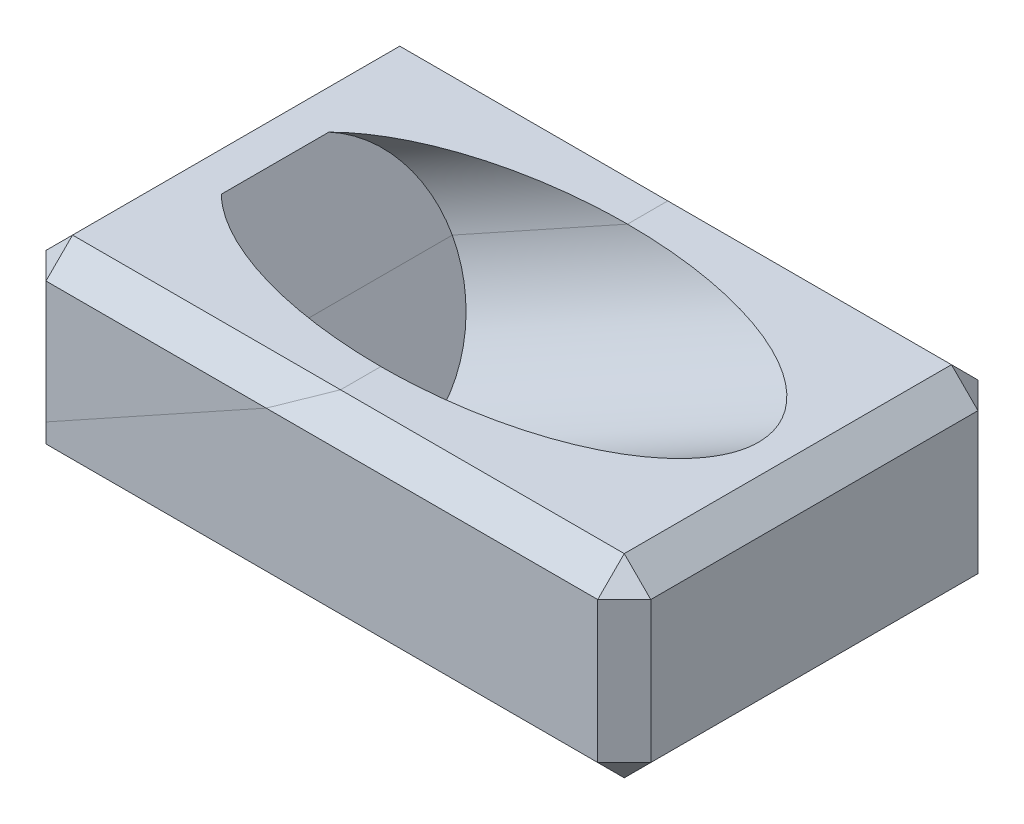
ISO-10303-21;
HEADER;
FILE_DESCRIPTION(('STEP AP214'),'2;1');
FILE_NAME('part.step','',(''),(''),'','','');
FILE_SCHEMA(('AUTOMOTIVE_DESIGN { 1 0 10303 214 1 1 1 1 }'));
ENDSEC;
DATA;
#1=APPLICATION_CONTEXT('core data for automotive mechanical design processes');
#2=APPLICATION_PROTOCOL_DEFINITION('international standard','automotive_design',2000,#1);
#3=PRODUCT_CONTEXT('',#1,'mechanical');
#4=PRODUCT('Part','Part','',(#3));
#5=PRODUCT_RELATED_PRODUCT_CATEGORY('part','',(#4));
#6=PRODUCT_DEFINITION_FORMATION('','',#4);
#7=PRODUCT_DEFINITION_CONTEXT('part definition',#1,'design');
#8=PRODUCT_DEFINITION('design','',#6,#7);
#9=PRODUCT_DEFINITION_SHAPE('','',#8);
#10=(LENGTH_UNIT() NAMED_UNIT(*) SI_UNIT(.MILLI.,.METRE.));
#11=(NAMED_UNIT(*) PLANE_ANGLE_UNIT() SI_UNIT($,.RADIAN.));
#12=(NAMED_UNIT(*) SI_UNIT($,.STERADIAN.) SOLID_ANGLE_UNIT());
#13=UNCERTAINTY_MEASURE_WITH_UNIT(LENGTH_MEASURE(1.E-05),#10,'distance_accuracy_value','');
#14=(GEOMETRIC_REPRESENTATION_CONTEXT(3) GLOBAL_UNCERTAINTY_ASSIGNED_CONTEXT((#13)) GLOBAL_UNIT_ASSIGNED_CONTEXT((#10,
#11,#12)) REPRESENTATION_CONTEXT('',''));
#15=CARTESIAN_POINT('',(0.,0.,0.));
#16=DIRECTION('',(0.,0.,1.));
#17=DIRECTION('',(1.,0.,0.));
#18=AXIS2_PLACEMENT_3D('',#15,#16,#17);
#19=CARTESIAN_POINT('',(-31.7413057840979,57.2628314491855,0.));
#20=DIRECTION('',(-0.484809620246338,0.874619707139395,0.));
#21=DIRECTION('',(-0.874619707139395,-0.484809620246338,0.));
#22=AXIS2_PLACEMENT_3D('',#19,#20,#21);
#23=PLANE('',#22);
#24=DIRECTION('',(0.658342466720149,0.364925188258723,-0.658342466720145));
#25=VECTOR('',#24,1.);
#26=CARTESIAN_POINT('',(-99.2119354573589,19.8632507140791,-76.4680645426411));
#27=LINE('',#26,#25);
#28=CARTESIAN_POINT('',(-114.,11.6660926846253,-61.68));
#29=VERTEX_POINT('',#28);
#30=CARTESIAN_POINT('',(-104.,17.2091831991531,-71.68));
#31=VERTEX_POINT('',#30);
#32=EDGE_CURVE('E56',#29,#31,#27,.T.);
#33=ORIENTED_EDGE('',*,*,#32,.T.);
#34=DIRECTION('',(0.874619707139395,0.484809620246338,0.));
#35=VECTOR('',#34,1.);
#36=CARTESIAN_POINT('',(-87.8996630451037,26.1337457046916,-71.68));
#37=LINE('',#36,#35);
#38=CARTESIAN_POINT('',(-20.9942892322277,63.22,-71.68));
#39=VERTEX_POINT('',#38);
#40=EDGE_CURVE('E222',#31,#39,#37,.T.);
#41=ORIENTED_EDGE('',*,*,#40,.T.);
#42=DIRECTION('',(0.787007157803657,0.436245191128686,0.436245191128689));
#43=VECTOR('',#42,1.);
#44=CARTESIAN_POINT('',(-78.6001911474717,31.2885271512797,-103.61147284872));
#45=LINE('',#44,#43);
#46=CARTESIAN_POINT('',(-2.95381167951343,73.22,-61.6799999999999));
#47=VERTEX_POINT('',#46);
#48=EDGE_CURVE('E218',#39,#47,#45,.T.);
#49=ORIENTED_EDGE('',*,*,#48,.T.);
#50=DIRECTION('',(0.,0.,-1.));
#51=VECTOR('',#50,1.);
#52=CARTESIAN_POINT('',(-2.95381167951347,73.22,0.));
#53=LINE('',#52,#51);
#54=CARTESIAN_POINT('',(-2.95381167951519,73.22,-46.5));
#55=VERTEX_POINT('',#54);
#56=EDGE_CURVE('E210',#55,#47,#53,.T.);
#57=ORIENTED_EDGE('',*,*,#56,.F.);
#58=DIRECTION('',(-0.874619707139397,-0.484809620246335,0.));
#59=VECTOR('',#58,1.);
#60=CARTESIAN_POINT('',(193.385912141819,182.052886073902,-46.5));
#61=LINE('',#60,#59);
#62=CARTESIAN_POINT('',(-69.0000000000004,36.6100000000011,-46.5));
#63=VERTEX_POINT('',#62);
#64=EDGE_CURVE('E140',#63,#55,#61,.F.);
#65=ORIENTED_EDGE('',*,*,#64,.F.);
#66=DIRECTION('',(0.,0.,-1.));
#67=VECTOR('',#66,1.);
#68=CARTESIAN_POINT('',(-68.9999999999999,36.6100000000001,0.));
#69=LINE('',#68,#67);
#70=CARTESIAN_POINT('',(-69.0000000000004,36.6100000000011,46.5));
#71=VERTEX_POINT('',#70);
#72=EDGE_CURVE('E153',#71,#63,#69,.T.);
#73=ORIENTED_EDGE('',*,*,#72,.F.);
#74=DIRECTION('',(-0.874619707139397,-0.484809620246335,0.));
#75=VECTOR('',#74,1.);
#76=CARTESIAN_POINT('',(193.385912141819,182.052886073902,46.5));
#77=LINE('',#76,#75);
#78=CARTESIAN_POINT('',(-2.95381167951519,73.22,46.5));
#79=VERTEX_POINT('',#78);
#80=EDGE_CURVE('E190',#79,#71,#77,.T.);
#81=ORIENTED_EDGE('',*,*,#80,.F.);
#82=CARTESIAN_POINT('',(-2.95381167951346,73.22,61.68));
#83=VERTEX_POINT('',#82);
#84=EDGE_CURVE('E211',#83,#79,#53,.T.);
#85=ORIENTED_EDGE('',*,*,#84,.F.);
#86=DIRECTION('',(0.787007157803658,0.436245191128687,-0.436245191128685));
#87=VECTOR('',#86,1.);
#88=CARTESIAN_POINT('',(-1.12427901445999,74.2341265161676,60.6658734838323));
#89=LINE('',#88,#87);
#90=CARTESIAN_POINT('',(-20.9942892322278,63.2199999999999,71.68));
#91=VERTEX_POINT('',#90);
#92=EDGE_CURVE('E12',#83,#91,#89,.F.);
#93=ORIENTED_EDGE('',*,*,#92,.T.);
#94=DIRECTION('',(0.874619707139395,0.484809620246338,0.));
#95=VECTOR('',#94,1.);
#96=CARTESIAN_POINT('',(-87.8996630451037,26.1337457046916,71.68));
#97=LINE('',#96,#95);
#98=CARTESIAN_POINT('',(-104.,17.2091831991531,71.68));
#99=VERTEX_POINT('',#98);
#100=EDGE_CURVE('E69',#99,#91,#97,.T.);
#101=ORIENTED_EDGE('',*,*,#100,.F.);
#102=DIRECTION('',(0.658342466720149,0.364925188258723,0.658342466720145));
#103=VECTOR('',#102,1.);
#104=CARTESIAN_POINT('',(-90.5436393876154,24.6681656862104,85.1363606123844));
#105=LINE('',#104,#103);
#106=CARTESIAN_POINT('',(-114.,11.6660926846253,61.68));
#107=VERTEX_POINT('',#106);
#108=EDGE_CURVE('E61',#99,#107,#105,.F.);
#109=ORIENTED_EDGE('',*,*,#108,.T.);
#110=DIRECTION('',(0.,0.,1.));
#111=VECTOR('',#110,1.);
#112=CARTESIAN_POINT('',(-114.,11.6660926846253,-71.68));
#113=LINE('',#112,#111);
#114=EDGE_CURVE('E215',#29,#107,#113,.T.);
#115=ORIENTED_EDGE('',*,*,#114,.F.);
#116=EDGE_LOOP('',(#33,#41,#49,#57,#65,#73,#81,#85,#93,#101,#109,#115));
#117=FACE_BOUND('',#116,.T.);
#118=ADVANCED_FACE('F53',(#117),#23,.F.);
#119=CARTESIAN_POINT('',(-104.,73.22,0.));
#120=DIRECTION('',(0.707106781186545,-0.707106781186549,0.));
#121=DIRECTION('',(0.,0.,1.));
#122=AXIS2_PLACEMENT_3D('',#119,#120,#121);
#123=PLANE('',#122);
#124=DIRECTION('',(-0.707106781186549,-0.707106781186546,0.));
#125=VECTOR('',#124,1.);
#126=CARTESIAN_POINT('',(-104.,73.22,-61.6799999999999));
#127=LINE('',#126,#125);
#128=CARTESIAN_POINT('',(-104.,73.22,-61.6799999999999));
#129=VERTEX_POINT('',#128);
#130=CARTESIAN_POINT('',(-114.,63.22,-61.68));
#131=VERTEX_POINT('',#130);
#132=EDGE_CURVE('E197',#129,#131,#127,.T.);
#133=ORIENTED_EDGE('',*,*,#132,.T.);
#134=DIRECTION('',(0.,0.,-1.));
#135=VECTOR('',#134,1.);
#136=CARTESIAN_POINT('',(-114.,63.22,-71.68));
#137=LINE('',#136,#135);
#138=CARTESIAN_POINT('',(-114.,63.22,61.68));
#139=VERTEX_POINT('',#138);
#140=EDGE_CURVE('E186',#139,#131,#137,.T.);
#141=ORIENTED_EDGE('',*,*,#140,.F.);
#142=DIRECTION('',(0.707106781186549,0.707106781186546,0.));
#143=VECTOR('',#142,1.);
#144=CARTESIAN_POINT('',(-109.,68.22,61.68));
#145=LINE('',#144,#143);
#146=CARTESIAN_POINT('',(-104.,73.22,61.68));
#147=VERTEX_POINT('',#146);
#148=EDGE_CURVE('E163',#147,#139,#145,.F.);
#149=ORIENTED_EDGE('',*,*,#148,.F.);
#150=DIRECTION('',(0.,0.,1.));
#151=VECTOR('',#150,1.);
#152=CARTESIAN_POINT('',(-104.,73.22,0.));
#153=LINE('',#152,#151);
#154=EDGE_CURVE('E166',#129,#147,#153,.T.);
#155=ORIENTED_EDGE('',*,*,#154,.F.);
#156=EDGE_LOOP('',(#133,#141,#149,#155));
#157=FACE_BOUND('',#156,.T.);
#158=ADVANCED_FACE('F266',(#157),#123,.F.);
#159=CARTESIAN_POINT('',(-114.,73.22,-71.68));
#160=DIRECTION('',(1.,0.,0.));
#161=DIRECTION('',(0.,0.,-1.));
#162=AXIS2_PLACEMENT_3D('',#159,#160,#161);
#163=PLANE('',#162);
#164=DIRECTION('',(0.,-1.,0.));
#165=VECTOR('',#164,1.);
#166=CARTESIAN_POINT('',(-114.,0.,-61.68));
#167=LINE('',#166,#165);
#168=EDGE_CURVE('E188',#131,#29,#167,.T.);
#169=ORIENTED_EDGE('',*,*,#168,.T.);
#170=ORIENTED_EDGE('',*,*,#114,.T.);
#171=DIRECTION('',(0.,1.,0.));
#172=VECTOR('',#171,1.);
#173=CARTESIAN_POINT('',(-114.,73.22,61.68));
#174=LINE('',#173,#172);
#175=EDGE_CURVE('E184',#107,#139,#174,.T.);
#176=ORIENTED_EDGE('',*,*,#175,.T.);
#177=ORIENTED_EDGE('',*,*,#140,.T.);
#178=EDGE_LOOP('',(#169,#170,#176,#177));
#179=FACE_BOUND('',#178,.T.);
#180=ADVANCED_FACE('F259',(#179),#163,.F.);
#181=CARTESIAN_POINT('',(-114.,73.22,71.68));
#182=DIRECTION('',(0.,0.,-1.));
#183=DIRECTION('',(-1.,0.,0.));
#184=AXIS2_PLACEMENT_3D('',#181,#182,#183);
#185=PLANE('',#184);
#186=DIRECTION('',(0.,-1.,0.));
#187=VECTOR('',#186,1.);
#188=CARTESIAN_POINT('',(-104.,73.22,71.68));
#189=LINE('',#188,#187);
#190=CARTESIAN_POINT('',(-104.,63.2199999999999,71.68));
#191=VERTEX_POINT('',#190);
#192=EDGE_CURVE('E174',#191,#99,#189,.T.);
#193=ORIENTED_EDGE('',*,*,#192,.T.);
#194=ORIENTED_EDGE('',*,*,#100,.T.);
#195=DIRECTION('',(-1.,0.,0.));
#196=VECTOR('',#195,1.);
#197=CARTESIAN_POINT('',(-114.,63.2199999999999,71.68));
#198=LINE('',#197,#196);
#199=EDGE_CURVE('E176',#91,#191,#198,.T.);
#200=ORIENTED_EDGE('',*,*,#199,.T.);
#201=EDGE_LOOP('',(#193,#194,#200));
#202=FACE_BOUND('',#201,.T.);
#203=ADVANCED_FACE('F257',(#202),#185,.F.);
#204=CARTESIAN_POINT('',(-104.,63.2199999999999,71.68));
#205=DIRECTION('',(-0.577350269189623,0.577350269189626,0.577350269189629));
#206=DIRECTION('',(0.,-0.707106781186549,0.707106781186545));
#207=AXIS2_PLACEMENT_3D('',#204,#205,#206);
#208=PLANE('',#207);
#209=ORIENTED_EDGE('',*,*,#148,.T.);
#210=DIRECTION('',(-0.707106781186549,0.,-0.707106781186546));
#211=VECTOR('',#210,1.);
#212=CARTESIAN_POINT('',(-104.,63.2199999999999,71.68));
#213=LINE('',#212,#211);
#214=EDGE_CURVE('E194',#139,#191,#213,.F.);
#215=ORIENTED_EDGE('',*,*,#214,.T.);
#216=DIRECTION('',(0.,-0.707106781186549,0.707106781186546));
#217=VECTOR('',#216,1.);
#218=CARTESIAN_POINT('',(-104.,63.2199999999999,71.68));
#219=LINE('',#218,#217);
#220=EDGE_CURVE('E160',#147,#191,#219,.T.);
#221=ORIENTED_EDGE('',*,*,#220,.F.);
#222=EDGE_LOOP('',(#209,#215,#221));
#223=FACE_BOUND('',#222,.T.);
#224=ADVANCED_FACE('F253',(#223),#208,.T.);
#225=CARTESIAN_POINT('',(-68.9999999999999,36.6100000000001,0.));
#226=DIRECTION('',(-0.874619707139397,-0.484809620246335,0.));
#227=DIRECTION('',(0.484809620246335,-0.874619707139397,0.));
#228=AXIS2_PLACEMENT_3D('',#225,#226,#227);
#229=PLANE('',#228);
#230=CARTESIAN_POINT('',(-68.9999999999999,36.6100000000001,0.));
#231=DIRECTION('',(-0.874619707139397,-0.484809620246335,0.));
#232=DIRECTION('',(0.484809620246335,-0.874619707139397,0.));
#233=AXIS2_PLACEMENT_3D('',#230,#231,#232);
#234=CIRCLE('',#233,46.5);
#235=CARTESIAN_POINT('',(-89.2932543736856,73.22,20.251956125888));
#236=VERTEX_POINT('',#235);
#237=EDGE_CURVE('E154',#71,#236,#234,.T.);
#238=ORIENTED_EDGE('',*,*,#237,.F.);
#239=ORIENTED_EDGE('',*,*,#72,.T.);
#240=CARTESIAN_POINT('',(-89.2932543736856,73.22,-20.251956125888));
#241=VERTEX_POINT('',#240);
#242=EDGE_CURVE('E138',#241,#63,#234,.T.);
#243=ORIENTED_EDGE('',*,*,#242,.F.);
#244=DIRECTION('',(0.,0.,-1.));
#245=VECTOR('',#244,1.);
#246=CARTESIAN_POINT('',(-89.2932543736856,73.22,0.));
#247=LINE('',#246,#245);
#248=EDGE_CURVE('E145',#236,#241,#247,.T.);
#249=ORIENTED_EDGE('',*,*,#248,.F.);
#250=EDGE_LOOP('',(#238,#239,#243,#249));
#251=FACE_BOUND('',#250,.T.);
#252=ADVANCED_FACE('F151',(#251),#229,.F.);
#253=CARTESIAN_POINT('',(0.,73.22,0.));
#254=DIRECTION('',(0.,-1.,0.));
#255=DIRECTION('',(0.,0.,-1.));
#256=AXIS2_PLACEMENT_3D('',#253,#254,#255);
#257=PLANE('',#256);
#258=DIRECTION('',(1.,0.,0.));
#259=VECTOR('',#258,1.);
#260=CARTESIAN_POINT('',(0.,73.22,61.68));
#261=LINE('',#260,#259);
#262=EDGE_CURVE('E172',#147,#83,#261,.T.);
#263=ORIENTED_EDGE('',*,*,#262,.T.);
#264=ORIENTED_EDGE('',*,*,#84,.T.);
#265=CARTESIAN_POINT('',(-2.95381167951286,73.22,0.));
#266=DIRECTION('',(0.,-1.,0.));
#267=DIRECTION('',(-1.,0.,0.));
#268=AXIS2_PLACEMENT_3D('',#265,#266,#267);
#269=ELLIPSE('',#268,95.9139382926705,46.5);
#270=EDGE_CURVE('E146',#79,#236,#269,.T.);
#271=ORIENTED_EDGE('',*,*,#270,.T.);
#272=ORIENTED_EDGE('',*,*,#248,.T.);
#273=EDGE_CURVE('E135',#241,#55,#269,.T.);
#274=ORIENTED_EDGE('',*,*,#273,.T.);
#275=ORIENTED_EDGE('',*,*,#56,.T.);
#276=DIRECTION('',(-1.,0.,0.));
#277=VECTOR('',#276,1.);
#278=CARTESIAN_POINT('',(-114.,73.22,-61.6799999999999));
#279=LINE('',#278,#277);
#280=EDGE_CURVE('E168',#47,#129,#279,.T.);
#281=ORIENTED_EDGE('',*,*,#280,.T.);
#282=ORIENTED_EDGE('',*,*,#154,.T.);
#283=EDGE_LOOP('',(#263,#264,#271,#272,#274,#275,#281,#282));
#284=FACE_BOUND('',#283,.T.);
#285=ADVANCED_FACE('F157',(#284),#257,.F.);
#286=CARTESIAN_POINT('',(193.385912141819,182.052886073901,0.));
#287=DIRECTION('',(-0.874619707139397,-0.484809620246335,0.));
#288=DIRECTION('',(0.484809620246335,-0.874619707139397,0.));
#289=AXIS2_PLACEMENT_3D('',#286,#287,#288);
#290=CYLINDRICAL_SURFACE('',#289,46.5);
#291=ORIENTED_EDGE('',*,*,#270,.F.);
#292=ORIENTED_EDGE('',*,*,#80,.T.);
#293=ORIENTED_EDGE('',*,*,#237,.T.);
#294=EDGE_LOOP('',(#291,#292,#293));
#295=FACE_BOUND('',#294,.T.);
#296=ADVANCED_FACE('F244',(#295),#290,.F.);
#297=ORIENTED_EDGE('',*,*,#242,.T.);
#298=ORIENTED_EDGE('',*,*,#64,.T.);
#299=ORIENTED_EDGE('',*,*,#273,.F.);
#300=EDGE_LOOP('',(#297,#298,#299));
#301=FACE_BOUND('',#300,.T.);
#302=ADVANCED_FACE('F137',(#301),#290,.F.);
#303=CARTESIAN_POINT('',(0.,73.22,61.68));
#304=DIRECTION('',(0.,-0.707106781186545,-0.707106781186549));
#305=DIRECTION('',(1.,0.,0.));
#306=AXIS2_PLACEMENT_3D('',#303,#304,#305);
#307=PLANE('',#306);
#308=ORIENTED_EDGE('',*,*,#92,.F.);
#309=ORIENTED_EDGE('',*,*,#262,.F.);
#310=ORIENTED_EDGE('',*,*,#220,.T.);
#311=ORIENTED_EDGE('',*,*,#199,.F.);
#312=EDGE_LOOP('',(#308,#309,#310,#311));
#313=FACE_BOUND('',#312,.T.);
#314=ADVANCED_FACE('F248',(#313),#307,.F.);
#315=CARTESIAN_POINT('',(-104.,73.22,71.68));
#316=DIRECTION('',(0.707106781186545,0.,-0.707106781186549));
#317=DIRECTION('',(0.,-1.,0.));
#318=AXIS2_PLACEMENT_3D('',#315,#316,#317);
#319=PLANE('',#318);
#320=ORIENTED_EDGE('',*,*,#108,.F.);
#321=ORIENTED_EDGE('',*,*,#192,.F.);
#322=ORIENTED_EDGE('',*,*,#214,.F.);
#323=ORIENTED_EDGE('',*,*,#175,.F.);
#324=EDGE_LOOP('',(#320,#321,#322,#323));
#325=FACE_BOUND('',#324,.T.);
#326=ADVANCED_FACE('F256',(#325),#319,.F.);
#327=CARTESIAN_POINT('',(-104.,73.22,-61.6799999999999));
#328=DIRECTION('',(-0.577350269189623,0.577350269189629,-0.577350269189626));
#329=DIRECTION('',(0.,0.707106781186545,0.707106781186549));
#330=AXIS2_PLACEMENT_3D('',#327,#328,#329);
#331=PLANE('',#330);
#332=DIRECTION('',(0.,-0.707106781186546,-0.707106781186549));
#333=VECTOR('',#332,1.);
#334=CARTESIAN_POINT('',(-104.,73.22,-61.6799999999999));
#335=LINE('',#334,#333);
#336=CARTESIAN_POINT('',(-104.,63.22,-71.68));
#337=VERTEX_POINT('',#336);
#338=EDGE_CURVE('E200',#129,#337,#335,.T.);
#339=ORIENTED_EDGE('',*,*,#338,.T.);
#340=DIRECTION('',(-0.707106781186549,0.,0.707106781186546));
#341=VECTOR('',#340,1.);
#342=CARTESIAN_POINT('',(-109.,63.22,-66.68));
#343=LINE('',#342,#341);
#344=EDGE_CURVE('E169',#337,#131,#343,.T.);
#345=ORIENTED_EDGE('',*,*,#344,.T.);
#346=ORIENTED_EDGE('',*,*,#132,.F.);
#347=EDGE_LOOP('',(#339,#345,#346));
#348=FACE_BOUND('',#347,.T.);
#349=ADVANCED_FACE('F282',(#348),#331,.T.);
#350=CARTESIAN_POINT('',(-114.,73.22,-71.68));
#351=DIRECTION('',(0.,0.,-1.));
#352=DIRECTION('',(-1.,0.,0.));
#353=AXIS2_PLACEMENT_3D('',#350,#351,#352);
#354=PLANE('',#353);
#355=ORIENTED_EDGE('',*,*,#40,.F.);
#356=DIRECTION('',(0.,1.,0.));
#357=VECTOR('',#356,1.);
#358=CARTESIAN_POINT('',(-104.,73.22,-71.68));
#359=LINE('',#358,#357);
#360=EDGE_CURVE('E178',#31,#337,#359,.T.);
#361=ORIENTED_EDGE('',*,*,#360,.T.);
#362=DIRECTION('',(1.,0.,0.));
#363=VECTOR('',#362,1.);
#364=CARTESIAN_POINT('',(114.,63.22,-71.68));
#365=LINE('',#364,#363);
#366=EDGE_CURVE('E180',#337,#39,#365,.T.);
#367=ORIENTED_EDGE('',*,*,#366,.T.);
#368=EDGE_LOOP('',(#355,#361,#367));
#369=FACE_BOUND('',#368,.T.);
#370=ADVANCED_FACE('F236',(#369),#354,.T.);
#371=CARTESIAN_POINT('',(-114.,63.22,-71.68));
#372=DIRECTION('',(0.,0.707106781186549,-0.707106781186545));
#373=DIRECTION('',(-1.,0.,0.));
#374=AXIS2_PLACEMENT_3D('',#371,#372,#373);
#375=PLANE('',#374);
#376=ORIENTED_EDGE('',*,*,#48,.F.);
#377=ORIENTED_EDGE('',*,*,#366,.F.);
#378=ORIENTED_EDGE('',*,*,#338,.F.);
#379=ORIENTED_EDGE('',*,*,#280,.F.);
#380=EDGE_LOOP('',(#376,#377,#378,#379));
#381=FACE_BOUND('',#380,.T.);
#382=ADVANCED_FACE('F239',(#381),#375,.T.);
#383=CARTESIAN_POINT('',(-114.,73.22,-61.68));
#384=DIRECTION('',(-0.707106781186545,0.,-0.707106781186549));
#385=DIRECTION('',(0.,1.,0.));
#386=AXIS2_PLACEMENT_3D('',#383,#384,#385);
#387=PLANE('',#386);
#388=ORIENTED_EDGE('',*,*,#32,.F.);
#389=ORIENTED_EDGE('',*,*,#168,.F.);
#390=ORIENTED_EDGE('',*,*,#344,.F.);
#391=ORIENTED_EDGE('',*,*,#360,.F.);
#392=EDGE_LOOP('',(#388,#389,#390,#391));
#393=FACE_BOUND('',#392,.T.);
#394=ADVANCED_FACE('F233',(#393),#387,.T.);
#395=CLOSED_SHELL('',(#118,#158,#180,#203,#224,#252,#285,#296,#302,#314,#326,#349,#370,#382,#394));
#396=MANIFOLD_SOLID_BREP('B2_NOT_SHOWN',#395);
#397=CARTESIAN_POINT('',(-31.7413057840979,57.2628314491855,0.));
#398=DIRECTION('',(-0.484809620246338,0.874619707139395,0.));
#399=DIRECTION('',(-0.874619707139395,-0.484809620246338,0.));
#400=AXIS2_PLACEMENT_3D('',#397,#398,#399);
#401=PLANE('',#400);
#402=DIRECTION('',(0.658342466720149,0.364925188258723,-0.658342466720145));
#403=VECTOR('',#402,1.);
#404=CARTESIAN_POINT('',(-99.2119354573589,19.8632507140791,-76.4680645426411));
#405=LINE('',#404,#403);
#406=CARTESIAN_POINT('',(-114.,11.6660926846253,-61.68));
#407=VERTEX_POINT('',#406);
#408=CARTESIAN_POINT('',(-104.,17.2091831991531,-71.68));
#409=VERTEX_POINT('',#408);
#410=EDGE_CURVE('E612',#407,#409,#405,.T.);
#411=ORIENTED_EDGE('',*,*,#410,.F.);
#412=DIRECTION('',(0.,0.,1.));
#413=VECTOR('',#412,1.);
#414=CARTESIAN_POINT('',(-114.,11.6660926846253,-71.68));
#415=LINE('',#414,#413);
#416=CARTESIAN_POINT('',(-114.,11.6660926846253,61.68));
#417=VERTEX_POINT('',#416);
#418=EDGE_CURVE('E618',#407,#417,#415,.T.);
#419=ORIENTED_EDGE('',*,*,#418,.T.);
#420=DIRECTION('',(0.658342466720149,0.364925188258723,0.658342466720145));
#421=VECTOR('',#420,1.);
#422=CARTESIAN_POINT('',(-90.5436393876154,24.6681656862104,85.1363606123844));
#423=LINE('',#422,#421);
#424=CARTESIAN_POINT('',(-104.,17.2091831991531,71.68));
#425=VERTEX_POINT('',#424);
#426=EDGE_CURVE('E608',#425,#417,#423,.F.);
#427=ORIENTED_EDGE('',*,*,#426,.F.);
#428=DIRECTION('',(0.874619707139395,0.484809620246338,0.));
#429=VECTOR('',#428,1.);
#430=CARTESIAN_POINT('',(-87.8996630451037,26.1337457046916,71.68));
#431=LINE('',#430,#429);
#432=CARTESIAN_POINT('',(-20.9942892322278,63.2199999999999,71.68));
#433=VERTEX_POINT('',#432);
#434=EDGE_CURVE('E621',#425,#433,#431,.T.);
#435=ORIENTED_EDGE('',*,*,#434,.T.);
#436=DIRECTION('',(0.787007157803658,0.436245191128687,-0.436245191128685));
#437=VECTOR('',#436,1.);
#438=CARTESIAN_POINT('',(-1.12427901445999,74.2341265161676,60.6658734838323));
#439=LINE('',#438,#437);
#440=CARTESIAN_POINT('',(-2.95381167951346,73.22,61.68));
#441=VERTEX_POINT('',#440);
#442=EDGE_CURVE('E606',#441,#433,#439,.F.);
#443=ORIENTED_EDGE('',*,*,#442,.F.);
#444=DIRECTION('',(0.,0.,-1.));
#445=VECTOR('',#444,1.);
#446=CARTESIAN_POINT('',(-2.95381167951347,73.22,0.));
#447=LINE('',#446,#445);
#448=CARTESIAN_POINT('',(-2.95381167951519,73.22,46.5));
#449=VERTEX_POINT('',#448);
#450=EDGE_CURVE('E623',#441,#449,#447,.T.);
#451=ORIENTED_EDGE('',*,*,#450,.T.);
#452=DIRECTION('',(-0.874619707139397,-0.484809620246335,0.));
#453=VECTOR('',#452,1.);
#454=CARTESIAN_POINT('',(193.385912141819,182.052886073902,46.5));
#455=LINE('',#454,#453);
#456=CARTESIAN_POINT('',(-69.0000000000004,36.6100000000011,46.5));
#457=VERTEX_POINT('',#456);
#458=EDGE_CURVE('E520',#449,#457,#455,.T.);
#459=ORIENTED_EDGE('',*,*,#458,.T.);
#460=DIRECTION('',(0.,0.,-1.));
#461=VECTOR('',#460,1.);
#462=CARTESIAN_POINT('',(-68.9999999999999,36.6100000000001,0.));
#463=LINE('',#462,#461);
#464=CARTESIAN_POINT('',(-69.0000000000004,36.6100000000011,-46.5));
#465=VERTEX_POINT('',#464);
#466=EDGE_CURVE('E509',#457,#465,#463,.T.);
#467=ORIENTED_EDGE('',*,*,#466,.T.);
#468=DIRECTION('',(-0.874619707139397,-0.484809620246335,0.));
#469=VECTOR('',#468,1.);
#470=CARTESIAN_POINT('',(193.385912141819,182.052886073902,-46.5));
#471=LINE('',#470,#469);
#472=CARTESIAN_POINT('',(-2.95381167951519,73.22,-46.5));
#473=VERTEX_POINT('',#472);
#474=EDGE_CURVE('E517',#465,#473,#471,.F.);
#475=ORIENTED_EDGE('',*,*,#474,.T.);
#476=CARTESIAN_POINT('',(-2.95381167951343,73.22,-61.6799999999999));
#477=VERTEX_POINT('',#476);
#478=EDGE_CURVE('E521',#473,#477,#447,.T.);
#479=ORIENTED_EDGE('',*,*,#478,.T.);
#480=DIRECTION('',(0.787007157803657,0.436245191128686,0.436245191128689));
#481=VECTOR('',#480,1.);
#482=CARTESIAN_POINT('',(-78.6001911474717,31.2885271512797,-103.61147284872));
#483=LINE('',#482,#481);
#484=CARTESIAN_POINT('',(-20.9942892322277,63.22,-71.68));
#485=VERTEX_POINT('',#484);
#486=EDGE_CURVE('E610',#485,#477,#483,.T.);
#487=ORIENTED_EDGE('',*,*,#486,.F.);
#488=DIRECTION('',(0.874619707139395,0.484809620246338,0.));
#489=VECTOR('',#488,1.);
#490=CARTESIAN_POINT('',(-87.8996630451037,26.1337457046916,-71.68));
#491=LINE('',#490,#489);
#492=EDGE_CURVE('E614',#409,#485,#491,.T.);
#493=ORIENTED_EDGE('',*,*,#492,.F.);
#494=EDGE_LOOP('',(#411,#419,#427,#435,#443,#451,#459,#467,#475,#479,#487,#493));
#495=FACE_BOUND('',#494,.T.);
#496=ADVANCED_FACE('F387',(#495),#401,.T.);
#497=CARTESIAN_POINT('',(-114.,73.22,-71.68));
#498=DIRECTION('',(0.,0.,-1.));
#499=DIRECTION('',(-1.,0.,0.));
#500=AXIS2_PLACEMENT_3D('',#497,#498,#499);
#501=PLANE('',#500);
#502=DIRECTION('',(0.,1.,0.));
#503=VECTOR('',#502,1.);
#504=CARTESIAN_POINT('',(-104.,73.22,-71.68));
#505=LINE('',#504,#503);
#506=CARTESIAN_POINT('',(-104.,10.,-71.68));
#507=VERTEX_POINT('',#506);
#508=EDGE_CURVE('E544',#507,#409,#505,.T.);
#509=ORIENTED_EDGE('',*,*,#508,.T.);
#510=ORIENTED_EDGE('',*,*,#492,.T.);
#511=DIRECTION('',(1.,0.,0.));
#512=VECTOR('',#511,1.);
#513=CARTESIAN_POINT('',(114.,63.22,-71.68));
#514=LINE('',#513,#512);
#515=CARTESIAN_POINT('',(104.,63.22,-71.68));
#516=VERTEX_POINT('',#515);
#517=EDGE_CURVE('E539',#485,#516,#514,.T.);
#518=ORIENTED_EDGE('',*,*,#517,.T.);
#519=DIRECTION('',(0.,-1.,0.));
#520=VECTOR('',#519,1.);
#521=CARTESIAN_POINT('',(104.,73.22,-71.68));
#522=LINE('',#521,#520);
#523=CARTESIAN_POINT('',(104.,10.,-71.68));
#524=VERTEX_POINT('',#523);
#525=EDGE_CURVE('E542',#516,#524,#522,.T.);
#526=ORIENTED_EDGE('',*,*,#525,.T.);
#527=DIRECTION('',(-1.,0.,0.));
#528=VECTOR('',#527,1.);
#529=CARTESIAN_POINT('',(-114.,10.,-71.68));
#530=LINE('',#529,#528);
#531=EDGE_CURVE('E548',#524,#507,#530,.T.);
#532=ORIENTED_EDGE('',*,*,#531,.T.);
#533=EDGE_LOOP('',(#509,#510,#518,#526,#532));
#534=FACE_BOUND('',#533,.T.);
#535=ADVANCED_FACE('F697',(#534),#501,.T.);
#536=CARTESIAN_POINT('',(-114.,73.22,-71.68));
#537=DIRECTION('',(1.,0.,0.));
#538=DIRECTION('',(0.,0.,-1.));
#539=AXIS2_PLACEMENT_3D('',#536,#537,#538);
#540=PLANE('',#539);
#541=ORIENTED_EDGE('',*,*,#418,.F.);
#542=DIRECTION('',(0.,-1.,0.));
#543=VECTOR('',#542,1.);
#544=CARTESIAN_POINT('',(-114.,0.,-61.68));
#545=LINE('',#544,#543);
#546=CARTESIAN_POINT('',(-114.,10.,-61.68));
#547=VERTEX_POINT('',#546);
#548=EDGE_CURVE('E533',#407,#547,#545,.T.);
#549=ORIENTED_EDGE('',*,*,#548,.T.);
#550=DIRECTION('',(0.,0.,1.));
#551=VECTOR('',#550,1.);
#552=CARTESIAN_POINT('',(-114.,10.,71.68));
#553=LINE('',#552,#551);
#554=CARTESIAN_POINT('',(-114.,10.,61.68));
#555=VERTEX_POINT('',#554);
#556=EDGE_CURVE('E538',#547,#555,#553,.T.);
#557=ORIENTED_EDGE('',*,*,#556,.T.);
#558=DIRECTION('',(0.,1.,0.));
#559=VECTOR('',#558,1.);
#560=CARTESIAN_POINT('',(-114.,73.22,61.68));
#561=LINE('',#560,#559);
#562=EDGE_CURVE('E535',#555,#417,#561,.T.);
#563=ORIENTED_EDGE('',*,*,#562,.T.);
#564=EDGE_LOOP('',(#541,#549,#557,#563));
#565=FACE_BOUND('',#564,.T.);
#566=ADVANCED_FACE('F735',(#565),#540,.F.);
#567=CARTESIAN_POINT('',(-114.,73.22,71.68));
#568=DIRECTION('',(0.,0.,-1.));
#569=DIRECTION('',(-1.,0.,0.));
#570=AXIS2_PLACEMENT_3D('',#567,#568,#569);
#571=PLANE('',#570);
#572=ORIENTED_EDGE('',*,*,#434,.F.);
#573=DIRECTION('',(0.,-1.,0.));
#574=VECTOR('',#573,1.);
#575=CARTESIAN_POINT('',(-104.,73.22,71.68));
#576=LINE('',#575,#574);
#577=CARTESIAN_POINT('',(-104.,10.,71.68));
#578=VERTEX_POINT('',#577);
#579=EDGE_CURVE('E552',#425,#578,#576,.T.);
#580=ORIENTED_EDGE('',*,*,#579,.T.);
#581=DIRECTION('',(1.,0.,0.));
#582=VECTOR('',#581,1.);
#583=CARTESIAN_POINT('',(114.,10.,71.68));
#584=LINE('',#583,#582);
#585=CARTESIAN_POINT('',(104.,10.,71.68));
#586=VERTEX_POINT('',#585);
#587=EDGE_CURVE('E554',#578,#586,#584,.T.);
#588=ORIENTED_EDGE('',*,*,#587,.T.);
#589=DIRECTION('',(0.,1.,0.));
#590=VECTOR('',#589,1.);
#591=CARTESIAN_POINT('',(104.,73.22,71.68));
#592=LINE('',#591,#590);
#593=CARTESIAN_POINT('',(104.,63.2199999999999,71.68));
#594=VERTEX_POINT('',#593);
#595=EDGE_CURVE('E551',#586,#594,#592,.T.);
#596=ORIENTED_EDGE('',*,*,#595,.T.);
#597=DIRECTION('',(-1.,0.,0.));
#598=VECTOR('',#597,1.);
#599=CARTESIAN_POINT('',(-114.,63.2199999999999,71.68));
#600=LINE('',#599,#598);
#601=EDGE_CURVE('E547',#594,#433,#600,.T.);
#602=ORIENTED_EDGE('',*,*,#601,.T.);
#603=EDGE_LOOP('',(#572,#580,#588,#596,#602));
#604=FACE_BOUND('',#603,.T.);
#605=ADVANCED_FACE('F742',(#604),#571,.F.);
#606=CARTESIAN_POINT('',(0.,73.22,0.));
#607=DIRECTION('',(0.,-1.,0.));
#608=DIRECTION('',(0.,0.,-1.));
#609=AXIS2_PLACEMENT_3D('',#606,#607,#608);
#610=PLANE('',#609);
#611=ORIENTED_EDGE('',*,*,#450,.F.);
#612=DIRECTION('',(1.,0.,0.));
#613=VECTOR('',#612,1.);
#614=CARTESIAN_POINT('',(0.,73.22,61.68));
#615=LINE('',#614,#613);
#616=CARTESIAN_POINT('',(104.,73.22,61.68));
#617=VERTEX_POINT('',#616);
#618=EDGE_CURVE('E555',#441,#617,#615,.T.);
#619=ORIENTED_EDGE('',*,*,#618,.T.);
#620=DIRECTION('',(0.,0.,-1.));
#621=VECTOR('',#620,1.);
#622=CARTESIAN_POINT('',(104.,73.22,-71.68));
#623=LINE('',#622,#621);
#624=CARTESIAN_POINT('',(104.,73.22,-61.6799999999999));
#625=VERTEX_POINT('',#624);
#626=EDGE_CURVE('E412',#617,#625,#623,.T.);
#627=ORIENTED_EDGE('',*,*,#626,.T.);
#628=DIRECTION('',(-1.,0.,0.));
#629=VECTOR('',#628,1.);
#630=CARTESIAN_POINT('',(-114.,73.22,-61.6799999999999));
#631=LINE('',#630,#629);
#632=EDGE_CURVE('E557',#625,#477,#631,.T.);
#633=ORIENTED_EDGE('',*,*,#632,.T.);
#634=ORIENTED_EDGE('',*,*,#478,.F.);
#635=CARTESIAN_POINT('',(-2.95381167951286,73.22,0.));
#636=DIRECTION('',(0.,-1.,0.));
#637=DIRECTION('',(-1.,0.,0.));
#638=AXIS2_PLACEMENT_3D('',#635,#636,#637);
#639=ELLIPSE('',#638,95.9139382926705,46.5);
#640=EDGE_CURVE('E524',#473,#449,#639,.T.);
#641=ORIENTED_EDGE('',*,*,#640,.T.);
#642=EDGE_LOOP('',(#611,#619,#627,#633,#634,#641));
#643=FACE_BOUND('',#642,.T.);
#644=ADVANCED_FACE('F745',(#643),#610,.F.);
#645=CARTESIAN_POINT('',(-114.,73.22,-61.68));
#646=DIRECTION('',(-0.707106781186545,0.,-0.707106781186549));
#647=DIRECTION('',(0.,1.,0.));
#648=AXIS2_PLACEMENT_3D('',#645,#646,#647);
#649=PLANE('',#648);
#650=ORIENTED_EDGE('',*,*,#548,.F.);
#651=ORIENTED_EDGE('',*,*,#410,.T.);
#652=ORIENTED_EDGE('',*,*,#508,.F.);
#653=DIRECTION('',(0.707106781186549,0.,-0.707106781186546));
#654=VECTOR('',#653,1.);
#655=CARTESIAN_POINT('',(-104.,10.,-71.68));
#656=LINE('',#655,#654);
#657=EDGE_CURVE('E639',#507,#547,#656,.F.);
#658=ORIENTED_EDGE('',*,*,#657,.T.);
#659=EDGE_LOOP('',(#650,#651,#652,#658));
#660=FACE_BOUND('',#659,.T.);
#661=ADVANCED_FACE('F389',(#660),#649,.T.);
#662=CARTESIAN_POINT('',(-114.,63.22,-71.68));
#663=DIRECTION('',(0.,0.707106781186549,-0.707106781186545));
#664=DIRECTION('',(-1.,0.,0.));
#665=AXIS2_PLACEMENT_3D('',#662,#663,#664);
#666=PLANE('',#665);
#667=ORIENTED_EDGE('',*,*,#517,.F.);
#668=ORIENTED_EDGE('',*,*,#486,.T.);
#669=ORIENTED_EDGE('',*,*,#632,.F.);
#670=DIRECTION('',(0.,0.707106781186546,0.707106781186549));
#671=VECTOR('',#670,1.);
#672=CARTESIAN_POINT('',(104.,63.22,-71.68));
#673=LINE('',#672,#671);
#674=EDGE_CURVE('E653',#516,#625,#673,.T.);
#675=ORIENTED_EDGE('',*,*,#674,.F.);
#676=EDGE_LOOP('',(#667,#668,#669,#675));
#677=FACE_BOUND('',#676,.T.);
#678=ADVANCED_FACE('F690',(#677),#666,.T.);
#679=CARTESIAN_POINT('',(-104.,73.22,71.68));
#680=DIRECTION('',(0.707106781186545,0.,-0.707106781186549));
#681=DIRECTION('',(0.,-1.,0.));
#682=AXIS2_PLACEMENT_3D('',#679,#680,#681);
#683=PLANE('',#682);
#684=ORIENTED_EDGE('',*,*,#579,.F.);
#685=ORIENTED_EDGE('',*,*,#426,.T.);
#686=ORIENTED_EDGE('',*,*,#562,.F.);
#687=DIRECTION('',(0.707106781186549,0.,0.707106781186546));
#688=VECTOR('',#687,1.);
#689=CARTESIAN_POINT('',(-109.,10.,66.68));
#690=LINE('',#689,#688);
#691=EDGE_CURVE('E667',#555,#578,#690,.T.);
#692=ORIENTED_EDGE('',*,*,#691,.T.);
#693=EDGE_LOOP('',(#684,#685,#686,#692));
#694=FACE_BOUND('',#693,.T.);
#695=ADVANCED_FACE('F739',(#694),#683,.F.);
#696=CARTESIAN_POINT('',(0.,73.22,61.68));
#697=DIRECTION('',(0.,-0.707106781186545,-0.707106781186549));
#698=DIRECTION('',(1.,0.,0.));
#699=AXIS2_PLACEMENT_3D('',#696,#697,#698);
#700=PLANE('',#699);
#701=ORIENTED_EDGE('',*,*,#618,.F.);
#702=ORIENTED_EDGE('',*,*,#442,.T.);
#703=ORIENTED_EDGE('',*,*,#601,.F.);
#704=DIRECTION('',(0.,0.707106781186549,-0.707106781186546));
#705=VECTOR('',#704,1.);
#706=CARTESIAN_POINT('',(104.,73.22,61.68));
#707=LINE('',#706,#705);
#708=EDGE_CURVE('E561',#594,#617,#707,.T.);
#709=ORIENTED_EDGE('',*,*,#708,.T.);
#710=EDGE_LOOP('',(#701,#702,#703,#709));
#711=FACE_BOUND('',#710,.T.);
#712=ADVANCED_FACE('F744',(#711),#700,.F.);
#713=CARTESIAN_POINT('',(-68.9999999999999,36.6100000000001,0.));
#714=DIRECTION('',(-0.874619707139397,-0.484809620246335,0.));
#715=DIRECTION('',(0.484809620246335,-0.874619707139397,0.));
#716=AXIS2_PLACEMENT_3D('',#713,#714,#715);
#717=PLANE('',#716);
#718=ORIENTED_EDGE('',*,*,#466,.F.);
#719=CARTESIAN_POINT('',(-68.9999999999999,36.6100000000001,0.));
#720=DIRECTION('',(-0.874619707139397,-0.484809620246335,0.));
#721=DIRECTION('',(0.484809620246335,-0.874619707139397,0.));
#722=AXIS2_PLACEMENT_3D('',#719,#720,#721);
#723=CIRCLE('',#722,46.5);
#724=CARTESIAN_POINT('',(-48.7067456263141,0.,20.2519561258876));
#725=VERTEX_POINT('',#724);
#726=EDGE_CURVE('E391',#725,#457,#723,.T.);
#727=ORIENTED_EDGE('',*,*,#726,.F.);
#728=DIRECTION('',(0.,0.,-1.));
#729=VECTOR('',#728,1.);
#730=CARTESIAN_POINT('',(-48.7067456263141,0.,0.));
#731=LINE('',#730,#729);
#732=CARTESIAN_POINT('',(-48.7067456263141,0.,-20.2519561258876));
#733=VERTEX_POINT('',#732);
#734=EDGE_CURVE('E512',#725,#733,#731,.T.);
#735=ORIENTED_EDGE('',*,*,#734,.T.);
#736=EDGE_CURVE('E51',#465,#733,#723,.T.);
#737=ORIENTED_EDGE('',*,*,#736,.F.);
#738=EDGE_LOOP('',(#718,#727,#735,#737));
#739=FACE_BOUND('',#738,.T.);
#740=ADVANCED_FACE('F508',(#739),#717,.F.);
#741=CARTESIAN_POINT('',(193.385912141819,182.052886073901,0.));
#742=DIRECTION('',(-0.874619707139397,-0.484809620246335,0.));
#743=DIRECTION('',(0.484809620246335,-0.874619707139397,0.));
#744=AXIS2_PLACEMENT_3D('',#741,#742,#743);
#745=CYLINDRICAL_SURFACE('',#744,46.5);
#746=ORIENTED_EDGE('',*,*,#474,.F.);
#747=ORIENTED_EDGE('',*,*,#736,.T.);
#748=CARTESIAN_POINT('',(-135.046188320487,0.,0.));
#749=DIRECTION('',(0.,-1.,0.));
#750=DIRECTION('',(-1.,0.,0.));
#751=AXIS2_PLACEMENT_3D('',#748,#749,#750);
#752=ELLIPSE('',#751,95.9139382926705,46.5);
#753=EDGE_CURVE('E401',#733,#725,#752,.T.);
#754=ORIENTED_EDGE('',*,*,#753,.T.);
#755=ORIENTED_EDGE('',*,*,#726,.T.);
#756=ORIENTED_EDGE('',*,*,#458,.F.);
#757=ORIENTED_EDGE('',*,*,#640,.F.);
#758=EDGE_LOOP('',(#746,#747,#754,#755,#756,#757));
#759=FACE_BOUND('',#758,.T.);
#760=ADVANCED_FACE('F523',(#759),#745,.F.);
#761=CARTESIAN_POINT('',(114.,73.22,-71.68));
#762=DIRECTION('',(1.,0.,0.));
#763=DIRECTION('',(0.,0.,-1.));
#764=AXIS2_PLACEMENT_3D('',#761,#762,#763);
#765=PLANE('',#764);
#766=DIRECTION('',(0.,0.,1.));
#767=VECTOR('',#766,1.);
#768=CARTESIAN_POINT('',(114.,63.22,71.68));
#769=LINE('',#768,#767);
#770=CARTESIAN_POINT('',(114.,63.22,-61.6799999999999));
#771=VERTEX_POINT('',#770);
#772=CARTESIAN_POINT('',(114.,63.22,61.68));
#773=VERTEX_POINT('',#772);
#774=EDGE_CURVE('E591',#771,#773,#769,.T.);
#775=ORIENTED_EDGE('',*,*,#774,.T.);
#776=DIRECTION('',(0.,-1.,0.));
#777=VECTOR('',#776,1.);
#778=CARTESIAN_POINT('',(114.,0.,61.68));
#779=LINE('',#778,#777);
#780=CARTESIAN_POINT('',(114.,10.,61.68));
#781=VERTEX_POINT('',#780);
#782=EDGE_CURVE('E588',#773,#781,#779,.T.);
#783=ORIENTED_EDGE('',*,*,#782,.T.);
#784=DIRECTION('',(0.,0.,-1.));
#785=VECTOR('',#784,1.);
#786=CARTESIAN_POINT('',(114.,10.,-71.68));
#787=LINE('',#786,#785);
#788=CARTESIAN_POINT('',(114.,10.,-61.6799999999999));
#789=VERTEX_POINT('',#788);
#790=EDGE_CURVE('E543',#781,#789,#787,.T.);
#791=ORIENTED_EDGE('',*,*,#790,.T.);
#792=DIRECTION('',(0.,1.,0.));
#793=VECTOR('',#792,1.);
#794=CARTESIAN_POINT('',(114.,73.22,-61.6799999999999));
#795=LINE('',#794,#793);
#796=EDGE_CURVE('E594',#789,#771,#795,.T.);
#797=ORIENTED_EDGE('',*,*,#796,.T.);
#798=EDGE_LOOP('',(#775,#783,#791,#797));
#799=FACE_BOUND('',#798,.T.);
#800=ADVANCED_FACE('F776',(#799),#765,.T.);
#801=CARTESIAN_POINT('',(0.,0.,0.));
#802=DIRECTION('',(0.,-1.,0.));
#803=DIRECTION('',(0.,0.,-1.));
#804=AXIS2_PLACEMENT_3D('',#801,#802,#803);
#805=PLANE('',#804);
#806=ORIENTED_EDGE('',*,*,#734,.F.);
#807=ORIENTED_EDGE('',*,*,#753,.F.);
#808=EDGE_LOOP('',(#806,#807));
#809=FACE_BOUND('',#808,.T.);
#810=DIRECTION('',(0.,0.,1.));
#811=VECTOR('',#810,1.);
#812=CARTESIAN_POINT('',(104.,0.,0.));
#813=LINE('',#812,#811);
#814=CARTESIAN_POINT('',(104.,0.,-61.6799999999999));
#815=VERTEX_POINT('',#814);
#816=CARTESIAN_POINT('',(104.,0.,61.6799999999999));
#817=VERTEX_POINT('',#816);
#818=EDGE_CURVE('E581',#815,#817,#813,.T.);
#819=ORIENTED_EDGE('',*,*,#818,.T.);
#820=DIRECTION('',(-1.,0.,0.));
#821=VECTOR('',#820,1.);
#822=CARTESIAN_POINT('',(-114.,0.,61.6799999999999));
#823=LINE('',#822,#821);
#824=CARTESIAN_POINT('',(-104.,0.,61.6799999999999));
#825=VERTEX_POINT('',#824);
#826=EDGE_CURVE('E578',#817,#825,#823,.T.);
#827=ORIENTED_EDGE('',*,*,#826,.T.);
#828=DIRECTION('',(0.,0.,-1.));
#829=VECTOR('',#828,1.);
#830=CARTESIAN_POINT('',(-104.,0.,-71.68));
#831=LINE('',#830,#829);
#832=CARTESIAN_POINT('',(-104.,0.,-61.6799999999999));
#833=VERTEX_POINT('',#832);
#834=EDGE_CURVE('E586',#825,#833,#831,.T.);
#835=ORIENTED_EDGE('',*,*,#834,.T.);
#836=DIRECTION('',(1.,0.,0.));
#837=VECTOR('',#836,1.);
#838=CARTESIAN_POINT('',(0.,0.,-61.6799999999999));
#839=LINE('',#838,#837);
#840=EDGE_CURVE('E584',#833,#815,#839,.T.);
#841=ORIENTED_EDGE('',*,*,#840,.T.);
#842=EDGE_LOOP('',(#819,#827,#835,#841));
#843=FACE_BOUND('',#842,.T.);
#844=ADVANCED_FACE('F626',(#809,#843),#805,.T.);
#845=CARTESIAN_POINT('',(0.,0.,-61.6799999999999));
#846=DIRECTION('',(0.,0.707106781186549,0.707106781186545));
#847=DIRECTION('',(1.,0.,0.));
#848=AXIS2_PLACEMENT_3D('',#845,#846,#847);
#849=PLANE('',#848);
#850=DIRECTION('',(0.,0.707106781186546,-0.707106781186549));
#851=VECTOR('',#850,1.);
#852=CARTESIAN_POINT('',(-104.,10.,-71.68));
#853=LINE('',#852,#851);
#854=EDGE_CURVE('E559',#507,#833,#853,.F.);
#855=ORIENTED_EDGE('',*,*,#854,.F.);
#856=ORIENTED_EDGE('',*,*,#531,.F.);
#857=DIRECTION('',(0.,-0.707106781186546,0.707106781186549));
#858=VECTOR('',#857,1.);
#859=CARTESIAN_POINT('',(104.,10.,-71.68));
#860=LINE('',#859,#858);
#861=EDGE_CURVE('E633',#815,#524,#860,.F.);
#862=ORIENTED_EDGE('',*,*,#861,.F.);
#863=ORIENTED_EDGE('',*,*,#840,.F.);
#864=EDGE_LOOP('',(#855,#856,#862,#863));
#865=FACE_BOUND('',#864,.T.);
#866=ADVANCED_FACE('F701',(#865),#849,.F.);
#867=CARTESIAN_POINT('',(-104.,10.,-71.68));
#868=DIRECTION('',(-0.577350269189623,-0.577350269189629,-0.577350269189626));
#869=DIRECTION('',(0.,0.707106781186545,-0.707106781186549));
#870=AXIS2_PLACEMENT_3D('',#867,#868,#869);
#871=PLANE('',#870);
#872=ORIENTED_EDGE('',*,*,#657,.F.);
#873=ORIENTED_EDGE('',*,*,#854,.T.);
#874=DIRECTION('',(-0.707106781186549,0.707106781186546,0.));
#875=VECTOR('',#874,1.);
#876=CARTESIAN_POINT('',(-109.,5.00000000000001,-61.68));
#877=LINE('',#876,#875);
#878=EDGE_CURVE('E636',#547,#833,#877,.F.);
#879=ORIENTED_EDGE('',*,*,#878,.F.);
#880=EDGE_LOOP('',(#872,#873,#879));
#881=FACE_BOUND('',#880,.T.);
#882=ADVANCED_FACE('F728',(#881),#871,.T.);
#883=CARTESIAN_POINT('',(104.,10.,-71.68));
#884=DIRECTION('',(0.577350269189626,-0.577350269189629,-0.577350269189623));
#885=DIRECTION('',(0.707106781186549,0.707106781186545,0.));
#886=AXIS2_PLACEMENT_3D('',#883,#884,#885);
#887=PLANE('',#886);
#888=DIRECTION('',(0.707106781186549,0.707106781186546,0.));
#889=VECTOR('',#888,1.);
#890=CARTESIAN_POINT('',(109.,5.,-61.6799999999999));
#891=LINE('',#890,#889);
#892=EDGE_CURVE('E645',#815,#789,#891,.T.);
#893=ORIENTED_EDGE('',*,*,#892,.F.);
#894=ORIENTED_EDGE('',*,*,#861,.T.);
#895=DIRECTION('',(-0.707106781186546,0.,-0.707106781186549));
#896=VECTOR('',#895,1.);
#897=CARTESIAN_POINT('',(104.,10.,-71.68));
#898=LINE('',#897,#896);
#899=EDGE_CURVE('E642',#789,#524,#898,.T.);
#900=ORIENTED_EDGE('',*,*,#899,.F.);
#901=EDGE_LOOP('',(#893,#894,#900));
#902=FACE_BOUND('',#901,.T.);
#903=ADVANCED_FACE('F706',(#902),#887,.T.);
#904=CARTESIAN_POINT('',(-114.,10.,-71.68));
#905=DIRECTION('',(-0.707106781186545,-0.707106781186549,0.));
#906=DIRECTION('',(0.,0.,-1.));
#907=AXIS2_PLACEMENT_3D('',#904,#905,#906);
#908=PLANE('',#907);
#909=ORIENTED_EDGE('',*,*,#878,.T.);
#910=ORIENTED_EDGE('',*,*,#834,.F.);
#911=DIRECTION('',(0.707106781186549,-0.707106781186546,0.));
#912=VECTOR('',#911,1.);
#913=CARTESIAN_POINT('',(-104.,0.,61.6799999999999));
#914=LINE('',#913,#912);
#915=EDGE_CURVE('E651',#555,#825,#914,.T.);
#916=ORIENTED_EDGE('',*,*,#915,.F.);
#917=ORIENTED_EDGE('',*,*,#556,.F.);
#918=EDGE_LOOP('',(#909,#910,#916,#917));
#919=FACE_BOUND('',#918,.T.);
#920=ADVANCED_FACE('F724',(#919),#908,.T.);
#921=CARTESIAN_POINT('',(104.,73.22,-71.68));
#922=DIRECTION('',(-0.707106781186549,0.,0.707106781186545));
#923=DIRECTION('',(0.,-1.,0.));
#924=AXIS2_PLACEMENT_3D('',#921,#922,#923);
#925=PLANE('',#924);
#926=ORIENTED_EDGE('',*,*,#899,.T.);
#927=ORIENTED_EDGE('',*,*,#525,.F.);
#928=DIRECTION('',(0.707106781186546,0.,0.707106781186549));
#929=VECTOR('',#928,1.);
#930=CARTESIAN_POINT('',(104.,63.22,-71.68));
#931=LINE('',#930,#929);
#932=EDGE_CURVE('E657',#771,#516,#931,.F.);
#933=ORIENTED_EDGE('',*,*,#932,.F.);
#934=ORIENTED_EDGE('',*,*,#796,.F.);
#935=EDGE_LOOP('',(#926,#927,#933,#934));
#936=FACE_BOUND('',#935,.T.);
#937=ADVANCED_FACE('F692',(#936),#925,.F.);
#938=CARTESIAN_POINT('',(104.,0.,0.));
#939=DIRECTION('',(-0.707106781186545,0.707106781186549,0.));
#940=DIRECTION('',(0.,0.,1.));
#941=AXIS2_PLACEMENT_3D('',#938,#939,#940);
#942=PLANE('',#941);
#943=ORIENTED_EDGE('',*,*,#892,.T.);
#944=ORIENTED_EDGE('',*,*,#790,.F.);
#945=DIRECTION('',(-0.707106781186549,-0.707106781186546,0.));
#946=VECTOR('',#945,1.);
#947=CARTESIAN_POINT('',(114.,10.,61.68));
#948=LINE('',#947,#946);
#949=EDGE_CURVE('E661',#817,#781,#948,.F.);
#950=ORIENTED_EDGE('',*,*,#949,.F.);
#951=ORIENTED_EDGE('',*,*,#818,.F.);
#952=EDGE_LOOP('',(#943,#944,#950,#951));
#953=FACE_BOUND('',#952,.T.);
#954=ADVANCED_FACE('F711',(#953),#942,.F.);
#955=CARTESIAN_POINT('',(-114.,10.,71.68));
#956=DIRECTION('',(0.,-0.707106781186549,0.707106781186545));
#957=DIRECTION('',(-1.,0.,0.));
#958=AXIS2_PLACEMENT_3D('',#955,#956,#957);
#959=PLANE('',#958);
#960=DIRECTION('',(0.,0.707106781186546,0.707106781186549));
#961=VECTOR('',#960,1.);
#962=CARTESIAN_POINT('',(-104.,0.,61.6799999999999));
#963=LINE('',#962,#961);
#964=EDGE_CURVE('E648',#825,#578,#963,.T.);
#965=ORIENTED_EDGE('',*,*,#964,.F.);
#966=ORIENTED_EDGE('',*,*,#826,.F.);
#967=DIRECTION('',(0.,-0.707106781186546,-0.707106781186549));
#968=VECTOR('',#967,1.);
#969=CARTESIAN_POINT('',(104.,5.,66.68));
#970=LINE('',#969,#968);
#971=EDGE_CURVE('E664',#586,#817,#970,.T.);
#972=ORIENTED_EDGE('',*,*,#971,.F.);
#973=ORIENTED_EDGE('',*,*,#587,.F.);
#974=EDGE_LOOP('',(#965,#966,#972,#973));
#975=FACE_BOUND('',#974,.T.);
#976=ADVANCED_FACE('F716',(#975),#959,.T.);
#977=CARTESIAN_POINT('',(-104.,0.,61.6799999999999));
#978=DIRECTION('',(-0.577350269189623,-0.577350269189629,0.577350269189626));
#979=DIRECTION('',(0.,-0.707106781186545,-0.707106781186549));
#980=AXIS2_PLACEMENT_3D('',#977,#978,#979);
#981=PLANE('',#980);
#982=ORIENTED_EDGE('',*,*,#915,.T.);
#983=ORIENTED_EDGE('',*,*,#964,.T.);
#984=ORIENTED_EDGE('',*,*,#691,.F.);
#985=EDGE_LOOP('',(#982,#983,#984));
#986=FACE_BOUND('',#985,.T.);
#987=ADVANCED_FACE('F801',(#986),#981,.T.);
#988=CARTESIAN_POINT('',(104.,63.22,-71.68));
#989=DIRECTION('',(0.577350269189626,0.577350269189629,-0.577350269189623));
#990=DIRECTION('',(-0.707106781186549,0.707106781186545,0.));
#991=AXIS2_PLACEMENT_3D('',#988,#989,#990);
#992=PLANE('',#991);
#993=ORIENTED_EDGE('',*,*,#932,.T.);
#994=ORIENTED_EDGE('',*,*,#674,.T.);
#995=DIRECTION('',(0.707106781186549,-0.707106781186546,0.));
#996=VECTOR('',#995,1.);
#997=CARTESIAN_POINT('',(109.,68.22,-61.6799999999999));
#998=LINE('',#997,#996);
#999=EDGE_CURVE('E670',#771,#625,#998,.F.);
#1000=ORIENTED_EDGE('',*,*,#999,.F.);
#1001=EDGE_LOOP('',(#993,#994,#1000));
#1002=FACE_BOUND('',#1001,.T.);
#1003=ADVANCED_FACE('F684',(#1002),#992,.T.);
#1004=CARTESIAN_POINT('',(114.,10.,61.68));
#1005=DIRECTION('',(0.577350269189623,-0.577350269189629,0.577350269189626));
#1006=DIRECTION('',(0.,-0.707106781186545,-0.707106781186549));
#1007=AXIS2_PLACEMENT_3D('',#1004,#1005,#1006);
#1008=PLANE('',#1007);
#1009=ORIENTED_EDGE('',*,*,#971,.T.);
#1010=ORIENTED_EDGE('',*,*,#949,.T.);
#1011=DIRECTION('',(-0.707106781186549,0.,0.707106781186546));
#1012=VECTOR('',#1011,1.);
#1013=CARTESIAN_POINT('',(114.,10.,61.68));
#1014=LINE('',#1013,#1012);
#1015=EDGE_CURVE('E674',#586,#781,#1014,.F.);
#1016=ORIENTED_EDGE('',*,*,#1015,.F.);
#1017=EDGE_LOOP('',(#1009,#1010,#1016));
#1018=FACE_BOUND('',#1017,.T.);
#1019=ADVANCED_FACE('F795',(#1018),#1008,.T.);
#1020=CARTESIAN_POINT('',(114.,63.22,-71.68));
#1021=DIRECTION('',(0.707106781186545,0.707106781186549,0.));
#1022=DIRECTION('',(0.,0.,-1.));
#1023=AXIS2_PLACEMENT_3D('',#1020,#1021,#1022);
#1024=PLANE('',#1023);
#1025=ORIENTED_EDGE('',*,*,#999,.T.);
#1026=ORIENTED_EDGE('',*,*,#626,.F.);
#1027=DIRECTION('',(-0.707106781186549,0.707106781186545,0.));
#1028=VECTOR('',#1027,1.);
#1029=CARTESIAN_POINT('',(104.,73.22,61.68));
#1030=LINE('',#1029,#1028);
#1031=EDGE_CURVE('E573',#773,#617,#1030,.T.);
#1032=ORIENTED_EDGE('',*,*,#1031,.F.);
#1033=ORIENTED_EDGE('',*,*,#774,.F.);
#1034=EDGE_LOOP('',(#1025,#1026,#1032,#1033));
#1035=FACE_BOUND('',#1034,.T.);
#1036=ADVANCED_FACE('F681',(#1035),#1024,.T.);
#1037=CARTESIAN_POINT('',(114.,73.22,61.68));
#1038=DIRECTION('',(0.707106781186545,0.,0.707106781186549));
#1039=DIRECTION('',(0.,1.,0.));
#1040=AXIS2_PLACEMENT_3D('',#1037,#1038,#1039);
#1041=PLANE('',#1040);
#1042=ORIENTED_EDGE('',*,*,#1015,.T.);
#1043=ORIENTED_EDGE('',*,*,#782,.F.);
#1044=DIRECTION('',(0.707106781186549,0.,-0.707106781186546));
#1045=VECTOR('',#1044,1.);
#1046=CARTESIAN_POINT('',(109.,63.22,66.68));
#1047=LINE('',#1046,#1045);
#1048=EDGE_CURVE('E565',#594,#773,#1047,.T.);
#1049=ORIENTED_EDGE('',*,*,#1048,.F.);
#1050=ORIENTED_EDGE('',*,*,#595,.F.);
#1051=EDGE_LOOP('',(#1042,#1043,#1049,#1050));
#1052=FACE_BOUND('',#1051,.T.);
#1053=ADVANCED_FACE('F789',(#1052),#1041,.T.);
#1054=CARTESIAN_POINT('',(104.,73.22,61.68));
#1055=DIRECTION('',(0.577350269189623,0.577350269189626,0.577350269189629));
#1056=DIRECTION('',(0.,-0.707106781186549,0.707106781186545));
#1057=AXIS2_PLACEMENT_3D('',#1054,#1055,#1056);
#1058=PLANE('',#1057);
#1059=ORIENTED_EDGE('',*,*,#1048,.T.);
#1060=ORIENTED_EDGE('',*,*,#1031,.T.);
#1061=ORIENTED_EDGE('',*,*,#708,.F.);
#1062=EDGE_LOOP('',(#1059,#1060,#1061));
#1063=FACE_BOUND('',#1062,.T.);
#1064=ADVANCED_FACE('F677',(#1063),#1058,.T.);
#1065=CLOSED_SHELL('',(#496,#535,#566,#605,#644,#661,#678,#695,#712,#740,#760,#800,#844,#866,
#882,#903,#920,#937,#954,#976,#987,#1003,#1019,#1036,#1053,#1064));
#1066=MANIFOLD_SOLID_BREP('B6',#1065);
#1067=ADVANCED_BREP_SHAPE_REPRESENTATION('',(#18,#396,#1066),#14);
#1068=SHAPE_DEFINITION_REPRESENTATION(#9,#1067);
ENDSEC;
END-ISO-10303-21;
